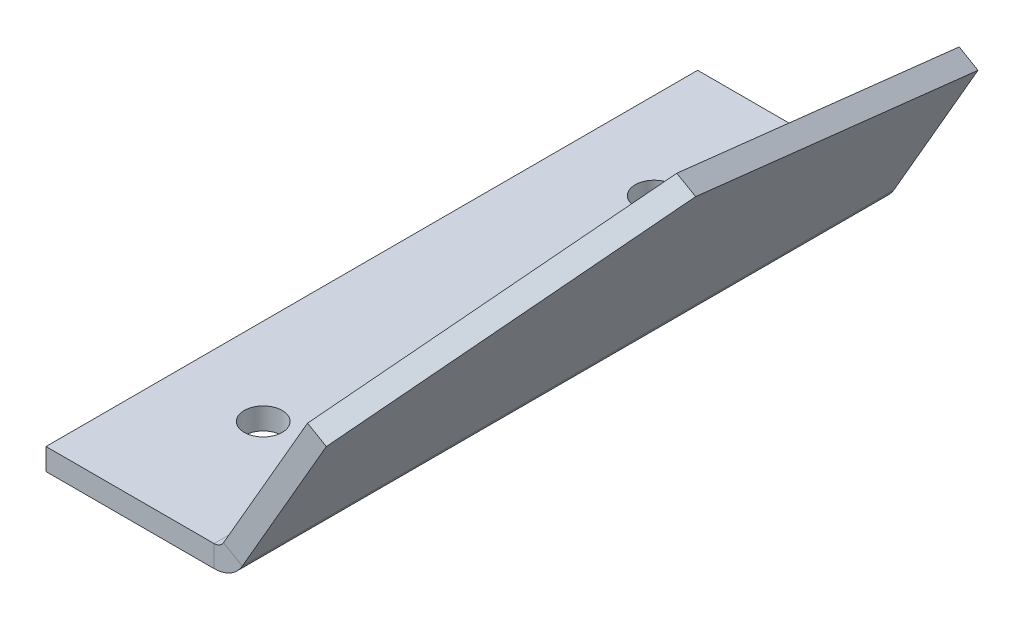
ISO-10303-21;
HEADER;
FILE_DESCRIPTION(('STEP AP214'),'2;1');
FILE_NAME('part.step','',(''),(''),'','','');
FILE_SCHEMA(('AUTOMOTIVE_DESIGN { 1 0 10303 214 1 1 1 1 }'));
ENDSEC;
DATA;
#1=APPLICATION_CONTEXT('core data for automotive mechanical design processes');
#2=APPLICATION_PROTOCOL_DEFINITION('international standard','automotive_design',2000,#1);
#3=PRODUCT_CONTEXT('',#1,'mechanical');
#4=PRODUCT('Part','Part','',(#3));
#5=PRODUCT_RELATED_PRODUCT_CATEGORY('part','',(#4));
#6=PRODUCT_DEFINITION_FORMATION('','',#4);
#7=PRODUCT_DEFINITION_CONTEXT('part definition',#1,'design');
#8=PRODUCT_DEFINITION('design','',#6,#7);
#9=PRODUCT_DEFINITION_SHAPE('','',#8);
#10=(LENGTH_UNIT() NAMED_UNIT(*) SI_UNIT(.MILLI.,.METRE.));
#11=(NAMED_UNIT(*) PLANE_ANGLE_UNIT() SI_UNIT($,.RADIAN.));
#12=(NAMED_UNIT(*) SI_UNIT($,.STERADIAN.) SOLID_ANGLE_UNIT());
#13=UNCERTAINTY_MEASURE_WITH_UNIT(LENGTH_MEASURE(1.E-05),#10,'distance_accuracy_value','');
#14=(GEOMETRIC_REPRESENTATION_CONTEXT(3) GLOBAL_UNCERTAINTY_ASSIGNED_CONTEXT((#13)) GLOBAL_UNIT_ASSIGNED_CONTEXT((#10,
#11,#12)) REPRESENTATION_CONTEXT('',''));
#15=CARTESIAN_POINT('',(0.,0.,0.));
#16=DIRECTION('',(0.,0.,1.));
#17=DIRECTION('',(1.,0.,0.));
#18=AXIS2_PLACEMENT_3D('',#15,#16,#17);
#19=CARTESIAN_POINT('',(-31.9193884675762,-11.8098653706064,30.));
#20=DIRECTION('',(0.,0.,-1.));
#21=DIRECTION('',(-0.499999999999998,-0.86602540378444,0.));
#22=AXIS2_PLACEMENT_3D('',#19,#20,#21);
#23=PLANE('',#22);
#24=DIRECTION('',(0.499999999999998,0.86602540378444,0.));
#25=VECTOR('',#24,1.);
#26=CARTESIAN_POINT('',(-31.9193884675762,-11.8098653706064,30.));
#27=LINE('',#26,#25);
#28=CARTESIAN_POINT('',(-23.6575838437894,2.5,30.));
#29=VERTEX_POINT('',#28);
#30=CARTESIAN_POINT('',(-15.9193884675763,15.9029475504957,30.));
#31=VERTEX_POINT('',#30);
#32=EDGE_CURVE('E60',#29,#31,#27,.T.);
#33=ORIENTED_EDGE('',*,*,#32,.F.);
#34=DIRECTION('',(0.86602540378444,-0.499999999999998,0.));
#35=VECTOR('',#34,1.);
#36=CARTESIAN_POINT('',(-23.6575838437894,2.5,30.));
#37=LINE('',#36,#35);
#38=CARTESIAN_POINT('',(-21.9255330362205,1.5,30.));
#39=VERTEX_POINT('',#38);
#40=EDGE_CURVE('E12',#29,#39,#37,.T.);
#41=ORIENTED_EDGE('',*,*,#40,.T.);
#42=DIRECTION('',(0.499999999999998,0.86602540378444,0.));
#43=VECTOR('',#42,1.);
#44=CARTESIAN_POINT('',(-30.1873376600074,-12.8098653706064,30.));
#45=LINE('',#44,#43);
#46=CARTESIAN_POINT('',(-14.1873376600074,14.9029475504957,30.));
#47=VERTEX_POINT('',#46);
#48=EDGE_CURVE('E77',#39,#47,#45,.T.);
#49=ORIENTED_EDGE('',*,*,#48,.T.);
#50=DIRECTION('',(0.86602540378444,-0.499999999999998,0.));
#51=VECTOR('',#50,1.);
#52=CARTESIAN_POINT('',(-15.9193884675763,15.9029475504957,30.));
#53=LINE('',#52,#51);
#54=EDGE_CURVE('E154',#31,#47,#53,.T.);
#55=ORIENTED_EDGE('',*,*,#54,.F.);
#56=EDGE_LOOP('',(#33,#41,#49,#55));
#57=FACE_BOUND('',#56,.T.);
#58=ADVANCED_FACE('F36',(#57),#23,.F.);
#59=CARTESIAN_POINT('',(-31.9193884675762,-11.8098653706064,-30.));
#60=DIRECTION('',(0.,0.,1.));
#61=DIRECTION('',(0.499999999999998,0.86602540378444,0.));
#62=AXIS2_PLACEMENT_3D('',#59,#60,#61);
#63=PLANE('',#62);
#64=DIRECTION('',(-0.499999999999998,-0.86602540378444,0.));
#65=VECTOR('',#64,1.);
#66=CARTESIAN_POINT('',(-30.1873376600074,-12.8098653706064,-30.));
#67=LINE('',#66,#65);
#68=CARTESIAN_POINT('',(-14.1873376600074,14.9029475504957,-30.));
#69=VERTEX_POINT('',#68);
#70=CARTESIAN_POINT('',(-21.9255330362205,1.50000000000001,-30.));
#71=VERTEX_POINT('',#70);
#72=EDGE_CURVE('E146',#69,#71,#67,.T.);
#73=ORIENTED_EDGE('',*,*,#72,.T.);
#74=DIRECTION('',(-0.86602540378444,0.499999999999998,0.));
#75=VECTOR('',#74,1.);
#76=CARTESIAN_POINT('',(-23.6575838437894,2.5,-30.));
#77=LINE('',#76,#75);
#78=CARTESIAN_POINT('',(-23.6575838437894,2.5,-30.));
#79=VERTEX_POINT('',#78);
#80=EDGE_CURVE('E124',#71,#79,#77,.T.);
#81=ORIENTED_EDGE('',*,*,#80,.T.);
#82=DIRECTION('',(-0.499999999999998,-0.86602540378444,0.));
#83=VECTOR('',#82,1.);
#84=CARTESIAN_POINT('',(-31.9193884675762,-11.8098653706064,-30.));
#85=LINE('',#84,#83);
#86=CARTESIAN_POINT('',(-15.9193884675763,15.9029475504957,-30.));
#87=VERTEX_POINT('',#86);
#88=EDGE_CURVE('E39',#87,#79,#85,.T.);
#89=ORIENTED_EDGE('',*,*,#88,.F.);
#90=DIRECTION('',(0.86602540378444,-0.499999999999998,0.));
#91=VECTOR('',#90,1.);
#92=CARTESIAN_POINT('',(-15.9193884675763,15.9029475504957,-30.));
#93=LINE('',#92,#91);
#94=EDGE_CURVE('E155',#87,#69,#93,.T.);
#95=ORIENTED_EDGE('',*,*,#94,.T.);
#96=EDGE_LOOP('',(#73,#81,#89,#95));
#97=FACE_BOUND('',#96,.T.);
#98=ADVANCED_FACE('F144',(#97),#63,.F.);
#99=CARTESIAN_POINT('',(-7.91938846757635,29.7593540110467,-30.));
#100=DIRECTION('',(0.86602540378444,-0.499999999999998,0.));
#101=DIRECTION('',(0.,0.,-1.));
#102=AXIS2_PLACEMENT_3D('',#99,#100,#101);
#103=PLANE('',#102);
#104=ORIENTED_EDGE('',*,*,#88,.T.);
#105=DIRECTION('',(0.,0.,1.));
#106=VECTOR('',#105,1.);
#107=CARTESIAN_POINT('',(-23.6575838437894,2.5,-30.));
#108=LINE('',#107,#106);
#109=EDGE_CURVE('E133',#79,#29,#108,.T.);
#110=ORIENTED_EDGE('',*,*,#109,.T.);
#111=ORIENTED_EDGE('',*,*,#32,.T.);
#112=DIRECTION('',(0.128831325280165,0.223142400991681,-0.966234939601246));
#113=VECTOR('',#112,1.);
#114=CARTESIAN_POINT('',(-15.9193884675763,15.9029475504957,30.));
#115=LINE('',#114,#113);
#116=CARTESIAN_POINT('',(-11.9193884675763,22.8311507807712,0.));
#117=VERTEX_POINT('',#116);
#118=EDGE_CURVE('E152',#31,#117,#115,.T.);
#119=ORIENTED_EDGE('',*,*,#118,.T.);
#120=DIRECTION('',(-0.128831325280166,-0.223142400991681,-0.966234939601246));
#121=VECTOR('',#120,1.);
#122=CARTESIAN_POINT('',(-15.9193884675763,15.9029475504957,-30.));
#123=LINE('',#122,#121);
#124=EDGE_CURVE('E83',#117,#87,#123,.T.);
#125=ORIENTED_EDGE('',*,*,#124,.T.);
#126=EDGE_LOOP('',(#104,#110,#111,#119,#125));
#127=FACE_BOUND('',#126,.T.);
#128=ADVANCED_FACE('F140',(#127),#103,.F.);
#129=CARTESIAN_POINT('',(-6.18733766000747,28.7593540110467,-30.));
#130=DIRECTION('',(0.86602540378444,-0.499999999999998,0.));
#131=DIRECTION('',(0.,0.,-1.));
#132=AXIS2_PLACEMENT_3D('',#129,#130,#131);
#133=PLANE('',#132);
#134=DIRECTION('',(0.,0.,1.));
#135=VECTOR('',#134,1.);
#136=CARTESIAN_POINT('',(-21.9255330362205,1.5,-30.));
#137=LINE('',#136,#135);
#138=EDGE_CURVE('E44',#71,#39,#137,.T.);
#139=ORIENTED_EDGE('',*,*,#138,.F.);
#140=ORIENTED_EDGE('',*,*,#72,.F.);
#141=DIRECTION('',(-0.128831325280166,-0.223142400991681,-0.966234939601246));
#142=VECTOR('',#141,1.);
#143=CARTESIAN_POINT('',(-14.1873376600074,14.9029475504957,-30.));
#144=LINE('',#143,#142);
#145=CARTESIAN_POINT('',(-10.1873376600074,21.8311507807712,0.));
#146=VERTEX_POINT('',#145);
#147=EDGE_CURVE('E153',#146,#69,#144,.T.);
#148=ORIENTED_EDGE('',*,*,#147,.F.);
#149=DIRECTION('',(0.128831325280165,0.223142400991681,-0.966234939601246));
#150=VECTOR('',#149,1.);
#151=CARTESIAN_POINT('',(-14.1873376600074,14.9029475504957,30.));
#152=LINE('',#151,#150);
#153=EDGE_CURVE('E166',#47,#146,#152,.T.);
#154=ORIENTED_EDGE('',*,*,#153,.F.);
#155=ORIENTED_EDGE('',*,*,#48,.F.);
#156=EDGE_LOOP('',(#139,#140,#148,#154,#155));
#157=FACE_BOUND('',#156,.T.);
#158=ADVANCED_FACE('F218',(#157),#133,.T.);
#159=CARTESIAN_POINT('',(-15.9193884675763,15.9029475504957,30.));
#160=DIRECTION('',(-0.483117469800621,-0.836784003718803,-0.257662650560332));
#161=DIRECTION('',(-0.128831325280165,-0.223142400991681,0.966234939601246));
#162=AXIS2_PLACEMENT_3D('',#159,#160,#161);
#163=PLANE('',#162);
#164=ORIENTED_EDGE('',*,*,#153,.T.);
#165=DIRECTION('',(0.86602540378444,-0.499999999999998,0.));
#166=VECTOR('',#165,1.);
#167=CARTESIAN_POINT('',(-11.9193884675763,22.8311507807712,0.));
#168=LINE('',#167,#166);
#169=EDGE_CURVE('E137',#117,#146,#168,.T.);
#170=ORIENTED_EDGE('',*,*,#169,.F.);
#171=ORIENTED_EDGE('',*,*,#118,.F.);
#172=ORIENTED_EDGE('',*,*,#54,.T.);
#173=EDGE_LOOP('',(#164,#170,#171,#172));
#174=FACE_BOUND('',#173,.T.);
#175=ADVANCED_FACE('F167',(#174),#163,.F.);
#176=CARTESIAN_POINT('',(-15.9193884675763,15.9029475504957,-30.));
#177=DIRECTION('',(-0.483117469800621,-0.836784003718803,0.257662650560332));
#178=DIRECTION('',(0.128831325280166,0.223142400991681,0.966234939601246));
#179=AXIS2_PLACEMENT_3D('',#176,#177,#178);
#180=PLANE('',#179);
#181=ORIENTED_EDGE('',*,*,#147,.T.);
#182=ORIENTED_EDGE('',*,*,#94,.F.);
#183=ORIENTED_EDGE('',*,*,#124,.F.);
#184=ORIENTED_EDGE('',*,*,#169,.T.);
#185=EDGE_LOOP('',(#181,#182,#183,#184));
#186=FACE_BOUND('',#185,.T.);
#187=ADVANCED_FACE('F165',(#186),#180,.F.);
#188=CARTESIAN_POINT('',(-32.,2.,18.));
#189=DIRECTION('',(0.,-1.,0.));
#190=DIRECTION('',(0.,0.,-1.));
#191=AXIS2_PLACEMENT_3D('',#188,#189,#190);
#192=CYLINDRICAL_SURFACE('',#191,1.75000000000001);
#193=CARTESIAN_POINT('',(-32.,2.,18.));
#194=DIRECTION('',(0.,1.,0.));
#195=DIRECTION('',(0.,0.,-1.));
#196=AXIS2_PLACEMENT_3D('',#193,#194,#195);
#197=CIRCLE('',#196,1.75000000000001);
#198=CARTESIAN_POINT('',(-32.,2.,16.25));
#199=VERTEX_POINT('',#198);
#200=EDGE_CURVE('E181',#199,#199,#197,.T.);
#201=ORIENTED_EDGE('',*,*,#200,.T.);
#202=EDGE_LOOP('',(#201));
#203=FACE_BOUND('',#202,.T.);
#204=CARTESIAN_POINT('',(-32.,0.,18.));
#205=DIRECTION('',(0.,1.,0.));
#206=DIRECTION('',(0.,0.,-1.));
#207=AXIS2_PLACEMENT_3D('',#204,#205,#206);
#208=CIRCLE('',#207,1.75000000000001);
#209=CARTESIAN_POINT('',(-32.,0.,16.25));
#210=VERTEX_POINT('',#209);
#211=EDGE_CURVE('E203',#210,#210,#208,.T.);
#212=ORIENTED_EDGE('',*,*,#211,.F.);
#213=EDGE_LOOP('',(#212));
#214=FACE_BOUND('',#213,.T.);
#215=ADVANCED_FACE('F236',(#203,#214),#192,.F.);
#216=CARTESIAN_POINT('',(-32.,2.,-18.));
#217=DIRECTION('',(0.,-1.,0.));
#218=DIRECTION('',(0.,0.,-1.));
#219=AXIS2_PLACEMENT_3D('',#216,#217,#218);
#220=CYLINDRICAL_SURFACE('',#219,1.75);
#221=CARTESIAN_POINT('',(-32.,2.,-18.));
#222=DIRECTION('',(0.,1.,0.));
#223=DIRECTION('',(0.,0.,1.));
#224=AXIS2_PLACEMENT_3D('',#221,#222,#223);
#225=CIRCLE('',#224,1.75);
#226=CARTESIAN_POINT('',(-32.,2.,-16.25));
#227=VERTEX_POINT('',#226);
#228=EDGE_CURVE('E184',#227,#227,#225,.T.);
#229=ORIENTED_EDGE('',*,*,#228,.T.);
#230=EDGE_LOOP('',(#229));
#231=FACE_BOUND('',#230,.T.);
#232=CARTESIAN_POINT('',(-32.,0.,-18.));
#233=DIRECTION('',(0.,1.,0.));
#234=DIRECTION('',(0.,0.,1.));
#235=AXIS2_PLACEMENT_3D('',#232,#233,#234);
#236=CIRCLE('',#235,1.75);
#237=CARTESIAN_POINT('',(-32.,0.,-16.25));
#238=VERTEX_POINT('',#237);
#239=EDGE_CURVE('E200',#238,#238,#236,.T.);
#240=ORIENTED_EDGE('',*,*,#239,.F.);
#241=EDGE_LOOP('',(#240));
#242=FACE_BOUND('',#241,.T.);
#243=ADVANCED_FACE('F258',(#231,#242),#220,.F.);
#244=CARTESIAN_POINT('',(-40.,2.,30.));
#245=DIRECTION('',(1.,0.,0.));
#246=DIRECTION('',(0.,0.,-1.));
#247=AXIS2_PLACEMENT_3D('',#244,#245,#246);
#248=PLANE('',#247);
#249=DIRECTION('',(0.,0.,1.));
#250=VECTOR('',#249,1.);
#251=CARTESIAN_POINT('',(-40.,0.,30.));
#252=LINE('',#251,#250);
#253=CARTESIAN_POINT('',(-40.,0.,-30.));
#254=VERTEX_POINT('',#253);
#255=CARTESIAN_POINT('',(-40.,0.,30.));
#256=VERTEX_POINT('',#255);
#257=EDGE_CURVE('E187',#254,#256,#252,.T.);
#258=ORIENTED_EDGE('',*,*,#257,.T.);
#259=DIRECTION('',(0.,-1.,0.));
#260=VECTOR('',#259,1.);
#261=CARTESIAN_POINT('',(-40.,2.,30.));
#262=LINE('',#261,#260);
#263=CARTESIAN_POINT('',(-40.,2.,30.));
#264=VERTEX_POINT('',#263);
#265=EDGE_CURVE('E170',#264,#256,#262,.T.);
#266=ORIENTED_EDGE('',*,*,#265,.F.);
#267=DIRECTION('',(0.,0.,1.));
#268=VECTOR('',#267,1.);
#269=CARTESIAN_POINT('',(-40.,2.,30.));
#270=LINE('',#269,#268);
#271=CARTESIAN_POINT('',(-40.,2.,-30.));
#272=VERTEX_POINT('',#271);
#273=EDGE_CURVE('E194',#272,#264,#270,.T.);
#274=ORIENTED_EDGE('',*,*,#273,.F.);
#275=DIRECTION('',(0.,-1.,0.));
#276=VECTOR('',#275,1.);
#277=CARTESIAN_POINT('',(-40.,2.,-30.));
#278=LINE('',#277,#276);
#279=EDGE_CURVE('E189',#272,#254,#278,.T.);
#280=ORIENTED_EDGE('',*,*,#279,.T.);
#281=EDGE_LOOP('',(#258,#266,#274,#280));
#282=FACE_BOUND('',#281,.T.);
#283=ADVANCED_FACE('F254',(#282),#248,.F.);
#284=CARTESIAN_POINT('',(7.99999999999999,2.,-30.));
#285=DIRECTION('',(0.,-1.,0.));
#286=DIRECTION('',(0.,0.,-1.));
#287=AXIS2_PLACEMENT_3D('',#284,#285,#286);
#288=PLANE('',#287);
#289=DIRECTION('',(0.,0.,1.));
#290=VECTOR('',#289,1.);
#291=CARTESIAN_POINT('',(-24.5236092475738,2.,-30.));
#292=LINE('',#291,#290);
#293=CARTESIAN_POINT('',(-24.5236092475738,2.,-30.));
#294=VERTEX_POINT('',#293);
#295=CARTESIAN_POINT('',(-24.5236092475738,2.,30.));
#296=VERTEX_POINT('',#295);
#297=EDGE_CURVE('E175',#294,#296,#292,.T.);
#298=ORIENTED_EDGE('',*,*,#297,.F.);
#299=DIRECTION('',(-1.,0.,0.));
#300=VECTOR('',#299,1.);
#301=CARTESIAN_POINT('',(-40.,2.,-30.));
#302=LINE('',#301,#300);
#303=EDGE_CURVE('E192',#294,#272,#302,.T.);
#304=ORIENTED_EDGE('',*,*,#303,.T.);
#305=ORIENTED_EDGE('',*,*,#273,.T.);
#306=DIRECTION('',(1.,0.,0.));
#307=VECTOR('',#306,1.);
#308=CARTESIAN_POINT('',(-40.,2.,30.));
#309=LINE('',#308,#307);
#310=EDGE_CURVE('E196',#264,#296,#309,.T.);
#311=ORIENTED_EDGE('',*,*,#310,.T.);
#312=EDGE_LOOP('',(#298,#304,#305,#311));
#313=FACE_BOUND('',#312,.T.);
#314=ORIENTED_EDGE('',*,*,#228,.F.);
#315=EDGE_LOOP('',(#314));
#316=FACE_BOUND('',#315,.T.);
#317=ORIENTED_EDGE('',*,*,#200,.F.);
#318=EDGE_LOOP('',(#317));
#319=FACE_BOUND('',#318,.T.);
#320=ADVANCED_FACE('F250',(#313,#316,#319),#288,.F.);
#321=CARTESIAN_POINT('',(-40.,2.,-30.));
#322=DIRECTION('',(0.,0.,1.));
#323=DIRECTION('',(1.,0.,0.));
#324=AXIS2_PLACEMENT_3D('',#321,#322,#323);
#325=PLANE('',#324);
#326=DIRECTION('',(0.,1.,0.));
#327=VECTOR('',#326,1.);
#328=CARTESIAN_POINT('',(-24.5236092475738,2.,-30.));
#329=LINE('',#328,#327);
#330=CARTESIAN_POINT('',(-24.5236092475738,0.,-30.));
#331=VERTEX_POINT('',#330);
#332=EDGE_CURVE('E126',#331,#294,#329,.T.);
#333=ORIENTED_EDGE('',*,*,#332,.F.);
#334=DIRECTION('',(-1.,0.,0.));
#335=VECTOR('',#334,1.);
#336=CARTESIAN_POINT('',(-40.,0.,-30.));
#337=LINE('',#336,#335);
#338=EDGE_CURVE('E198',#331,#254,#337,.T.);
#339=ORIENTED_EDGE('',*,*,#338,.T.);
#340=ORIENTED_EDGE('',*,*,#279,.F.);
#341=ORIENTED_EDGE('',*,*,#303,.F.);
#342=EDGE_LOOP('',(#333,#339,#340,#341));
#343=FACE_BOUND('',#342,.T.);
#344=ADVANCED_FACE('F246',(#343),#325,.F.);
#345=CARTESIAN_POINT('',(7.99999999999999,0.,-30.));
#346=DIRECTION('',(0.,-1.,0.));
#347=DIRECTION('',(0.,0.,-1.));
#348=AXIS2_PLACEMENT_3D('',#345,#346,#347);
#349=PLANE('',#348);
#350=ORIENTED_EDGE('',*,*,#239,.T.);
#351=EDGE_LOOP('',(#350));
#352=FACE_BOUND('',#351,.T.);
#353=ORIENTED_EDGE('',*,*,#211,.T.);
#354=EDGE_LOOP('',(#353));
#355=FACE_BOUND('',#354,.T.);
#356=ORIENTED_EDGE('',*,*,#338,.F.);
#357=DIRECTION('',(0.,0.,1.));
#358=VECTOR('',#357,1.);
#359=CARTESIAN_POINT('',(-24.5236092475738,0.,-30.));
#360=LINE('',#359,#358);
#361=CARTESIAN_POINT('',(-24.5236092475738,0.,30.));
#362=VERTEX_POINT('',#361);
#363=EDGE_CURVE('E206',#331,#362,#360,.T.);
#364=ORIENTED_EDGE('',*,*,#363,.T.);
#365=DIRECTION('',(1.,0.,0.));
#366=VECTOR('',#365,1.);
#367=CARTESIAN_POINT('',(-40.,0.,30.));
#368=LINE('',#367,#366);
#369=EDGE_CURVE('E169',#256,#362,#368,.T.);
#370=ORIENTED_EDGE('',*,*,#369,.F.);
#371=ORIENTED_EDGE('',*,*,#257,.F.);
#372=EDGE_LOOP('',(#356,#364,#370,#371));
#373=FACE_BOUND('',#372,.T.);
#374=ADVANCED_FACE('F242',(#352,#355,#373),#349,.T.);
#375=CARTESIAN_POINT('',(-40.,2.,30.));
#376=DIRECTION('',(0.,0.,-1.));
#377=DIRECTION('',(-1.,0.,0.));
#378=AXIS2_PLACEMENT_3D('',#375,#376,#377);
#379=PLANE('',#378);
#380=DIRECTION('',(0.,-1.,0.));
#381=VECTOR('',#380,1.);
#382=CARTESIAN_POINT('',(-24.5236092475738,2.,30.));
#383=LINE('',#382,#381);
#384=EDGE_CURVE('E177',#296,#362,#383,.T.);
#385=ORIENTED_EDGE('',*,*,#384,.F.);
#386=ORIENTED_EDGE('',*,*,#310,.F.);
#387=ORIENTED_EDGE('',*,*,#265,.T.);
#388=ORIENTED_EDGE('',*,*,#369,.T.);
#389=EDGE_LOOP('',(#385,#386,#387,#388));
#390=FACE_BOUND('',#389,.T.);
#391=ADVANCED_FACE('F239',(#390),#379,.F.);
#392=CARTESIAN_POINT('',(-24.5236092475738,3.,-30.));
#393=DIRECTION('',(0.,0.,1.));
#394=DIRECTION('',(1.,0.,0.));
#395=AXIS2_PLACEMENT_3D('',#392,#393,#394);
#396=PLANE('',#395);
#397=ORIENTED_EDGE('',*,*,#80,.F.);
#398=CARTESIAN_POINT('',(-24.5236092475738,3.,-30.));
#399=DIRECTION('',(0.,0.,-1.));
#400=DIRECTION('',(-1.,0.,0.));
#401=AXIS2_PLACEMENT_3D('',#398,#399,#400);
#402=CIRCLE('',#401,3.);
#403=EDGE_CURVE('E211',#71,#331,#402,.T.);
#404=ORIENTED_EDGE('',*,*,#403,.T.);
#405=ORIENTED_EDGE('',*,*,#332,.T.);
#406=CARTESIAN_POINT('',(-24.5236092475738,3.,-30.));
#407=DIRECTION('',(0.,0.,-1.));
#408=DIRECTION('',(-1.,0.,0.));
#409=AXIS2_PLACEMENT_3D('',#406,#407,#408);
#410=CIRCLE('',#409,1.);
#411=EDGE_CURVE('E119',#79,#294,#410,.T.);
#412=ORIENTED_EDGE('',*,*,#411,.F.);
#413=EDGE_LOOP('',(#397,#404,#405,#412));
#414=FACE_BOUND('',#413,.T.);
#415=ADVANCED_FACE('F121',(#414),#396,.F.);
#416=CARTESIAN_POINT('',(-24.5236092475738,3.,30.));
#417=DIRECTION('',(0.,0.,-1.));
#418=DIRECTION('',(-1.,0.,0.));
#419=AXIS2_PLACEMENT_3D('',#416,#417,#418);
#420=PLANE('',#419);
#421=ORIENTED_EDGE('',*,*,#384,.T.);
#422=CARTESIAN_POINT('',(-24.5236092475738,3.,30.));
#423=DIRECTION('',(0.,0.,-1.));
#424=DIRECTION('',(-1.,0.,0.));
#425=AXIS2_PLACEMENT_3D('',#422,#423,#424);
#426=CIRCLE('',#425,3.);
#427=EDGE_CURVE('E130',#362,#39,#426,.F.);
#428=ORIENTED_EDGE('',*,*,#427,.T.);
#429=ORIENTED_EDGE('',*,*,#40,.F.);
#430=CARTESIAN_POINT('',(-24.5236092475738,3.,30.));
#431=DIRECTION('',(0.,0.,1.));
#432=DIRECTION('',(1.,0.,0.));
#433=AXIS2_PLACEMENT_3D('',#430,#431,#432);
#434=CIRCLE('',#433,1.);
#435=EDGE_CURVE('E129',#296,#29,#434,.T.);
#436=ORIENTED_EDGE('',*,*,#435,.F.);
#437=EDGE_LOOP('',(#421,#428,#429,#436));
#438=FACE_BOUND('',#437,.T.);
#439=ADVANCED_FACE('F215',(#438),#420,.F.);
#440=CARTESIAN_POINT('',(-24.5236092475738,3.,60.0424571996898));
#441=DIRECTION('',(0.,0.,-1.));
#442=DIRECTION('',(-1.,0.,0.));
#443=AXIS2_PLACEMENT_3D('',#440,#441,#442);
#444=CYLINDRICAL_SURFACE('',#443,1.);
#445=ORIENTED_EDGE('',*,*,#435,.T.);
#446=ORIENTED_EDGE('',*,*,#109,.F.);
#447=ORIENTED_EDGE('',*,*,#411,.T.);
#448=ORIENTED_EDGE('',*,*,#297,.T.);
#449=EDGE_LOOP('',(#445,#446,#447,#448));
#450=FACE_BOUND('',#449,.T.);
#451=ADVANCED_FACE('F135',(#450),#444,.F.);
#452=CARTESIAN_POINT('',(-24.5236092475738,3.,60.0424571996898));
#453=DIRECTION('',(0.,0.,-1.));
#454=DIRECTION('',(-1.,0.,0.));
#455=AXIS2_PLACEMENT_3D('',#452,#453,#454);
#456=CYLINDRICAL_SURFACE('',#455,3.);
#457=ORIENTED_EDGE('',*,*,#427,.F.);
#458=ORIENTED_EDGE('',*,*,#363,.F.);
#459=ORIENTED_EDGE('',*,*,#403,.F.);
#460=ORIENTED_EDGE('',*,*,#138,.T.);
#461=EDGE_LOOP('',(#457,#458,#459,#460));
#462=FACE_BOUND('',#461,.T.);
#463=ADVANCED_FACE('F270',(#462),#456,.T.);
#464=CLOSED_SHELL('',(#58,#98,#128,#158,#175,#187,#215,#243,#283,#320,#344,#374,#391,#415,#439,
#451,#463));
#465=MANIFOLD_SOLID_BREP('B2',#464);
#466=ADVANCED_BREP_SHAPE_REPRESENTATION('',(#18,#465),#14);
#467=SHAPE_DEFINITION_REPRESENTATION(#9,#466);
ENDSEC;
END-ISO-10303-21;
